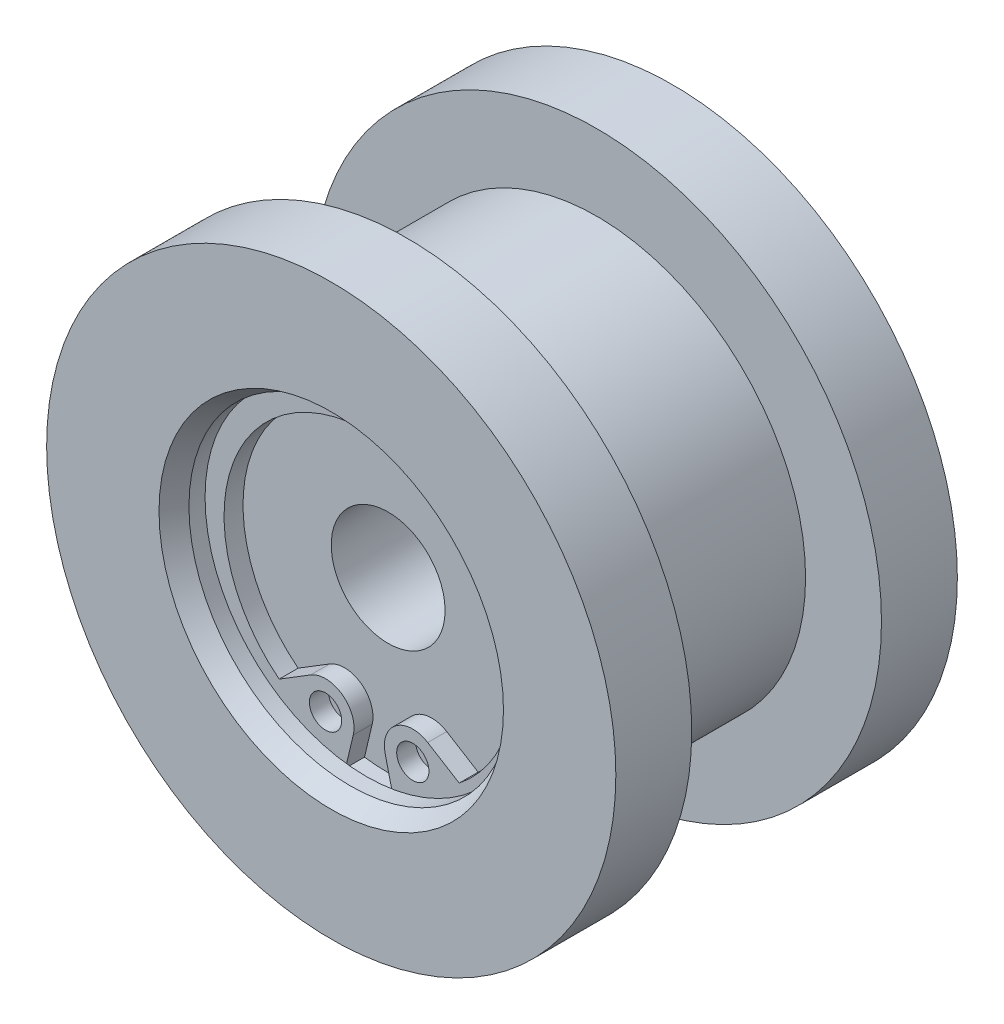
ISO-10303-21;
HEADER;
FILE_DESCRIPTION(('STEP AP214'),'2;1');
FILE_NAME('part.step','',(''),(''),'','','');
FILE_SCHEMA(('AUTOMOTIVE_DESIGN { 1 0 10303 214 1 1 1 1 }'));
ENDSEC;
DATA;
#1=APPLICATION_CONTEXT('core data for automotive mechanical design processes');
#2=APPLICATION_PROTOCOL_DEFINITION('international standard','automotive_design',2000,#1);
#3=PRODUCT_CONTEXT('',#1,'mechanical');
#4=PRODUCT('Part','Part','',(#3));
#5=PRODUCT_RELATED_PRODUCT_CATEGORY('part','',(#4));
#6=PRODUCT_DEFINITION_FORMATION('','',#4);
#7=PRODUCT_DEFINITION_CONTEXT('part definition',#1,'design');
#8=PRODUCT_DEFINITION('design','',#6,#7);
#9=PRODUCT_DEFINITION_SHAPE('','',#8);
#10=(LENGTH_UNIT() NAMED_UNIT(*) SI_UNIT(.MILLI.,.METRE.));
#11=(NAMED_UNIT(*) PLANE_ANGLE_UNIT() SI_UNIT($,.RADIAN.));
#12=(NAMED_UNIT(*) SI_UNIT($,.STERADIAN.) SOLID_ANGLE_UNIT());
#13=UNCERTAINTY_MEASURE_WITH_UNIT(LENGTH_MEASURE(1.E-05),#10,'distance_accuracy_value','');
#14=(GEOMETRIC_REPRESENTATION_CONTEXT(3) GLOBAL_UNCERTAINTY_ASSIGNED_CONTEXT((#13)) GLOBAL_UNIT_ASSIGNED_CONTEXT((#10,
#11,#12)) REPRESENTATION_CONTEXT('',''));
#15=CARTESIAN_POINT('',(0.,0.,0.));
#16=DIRECTION('',(0.,0.,1.));
#17=DIRECTION('',(1.,0.,0.));
#18=AXIS2_PLACEMENT_3D('',#15,#16,#17);
#19=CARTESIAN_POINT('',(0.,-0.5,7.));
#20=DIRECTION('',(0.,0.,1.));
#21=DIRECTION('',(-1.,0.,0.));
#22=AXIS2_PLACEMENT_3D('',#19,#20,#21);
#23=CYLINDRICAL_SURFACE('',#22,7.65);
#24=CARTESIAN_POINT('',(0.,-0.5,6.));
#25=DIRECTION('',(0.,0.,-1.));
#26=DIRECTION('',(0.,-1.,0.));
#27=AXIS2_PLACEMENT_3D('',#24,#25,#26);
#28=CIRCLE('',#27,7.65);
#29=CARTESIAN_POINT('',(-4.74513893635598,-6.50051301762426,6.));
#30=VERTEX_POINT('',#29);
#31=CARTESIAN_POINT('',(4.74513893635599,-6.50051301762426,6.));
#32=VERTEX_POINT('',#31);
#33=EDGE_CURVE('E110',#30,#32,#28,.T.);
#34=ORIENTED_EDGE('',*,*,#33,.T.);
#35=DIRECTION('',(0.,0.,-1.));
#36=VECTOR('',#35,1.);
#37=CARTESIAN_POINT('',(4.74513893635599,-6.50051301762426,7.));
#38=LINE('',#37,#36);
#39=CARTESIAN_POINT('',(4.74513893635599,-6.50051301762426,7.));
#40=VERTEX_POINT('',#39);
#41=EDGE_CURVE('E136',#40,#32,#38,.T.);
#42=ORIENTED_EDGE('',*,*,#41,.F.);
#43=CARTESIAN_POINT('',(0.,-0.5,7.));
#44=DIRECTION('',(0.,0.,-1.));
#45=DIRECTION('',(0.,-1.,0.));
#46=AXIS2_PLACEMENT_3D('',#43,#44,#45);
#47=CIRCLE('',#46,7.65);
#48=CARTESIAN_POINT('',(-4.74513893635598,-6.50051301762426,7.));
#49=VERTEX_POINT('',#48);
#50=EDGE_CURVE('E137',#49,#40,#47,.T.);
#51=ORIENTED_EDGE('',*,*,#50,.F.);
#52=DIRECTION('',(0.,0.,-1.));
#53=VECTOR('',#52,1.);
#54=CARTESIAN_POINT('',(-4.74513893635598,-6.50051301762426,7.));
#55=LINE('',#54,#53);
#56=EDGE_CURVE('E165',#49,#30,#55,.T.);
#57=ORIENTED_EDGE('',*,*,#56,.T.);
#58=EDGE_LOOP('',(#34,#42,#51,#57));
#59=FACE_BOUND('',#58,.T.);
#60=ADVANCED_FACE('F14',(#59),#23,.F.);
#61=CARTESIAN_POINT('',(3.08650226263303,-5.47917588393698,7.));
#62=DIRECTION('',(-0.524334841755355,-0.851512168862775,0.));
#63=DIRECTION('',(-0.851512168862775,0.524334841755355,0.));
#64=AXIS2_PLACEMENT_3D('',#61,#62,#63);
#65=PLANE('',#64);
#66=DIRECTION('',(-0.851512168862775,0.524334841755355,0.));
#67=VECTOR('',#66,1.);
#68=CARTESIAN_POINT('',(3.08650226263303,-5.47917588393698,6.));
#69=LINE('',#68,#67);
#70=CARTESIAN_POINT('',(3.08650226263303,-5.47917588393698,6.));
#71=VERTEX_POINT('',#70);
#72=EDGE_CURVE('E150',#32,#71,#69,.T.);
#73=ORIENTED_EDGE('',*,*,#72,.T.);
#74=DIRECTION('',(0.,0.,-1.));
#75=VECTOR('',#74,1.);
#76=CARTESIAN_POINT('',(3.08650226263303,-5.47917588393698,7.));
#77=LINE('',#76,#75);
#78=CARTESIAN_POINT('',(3.08650226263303,-5.47917588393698,7.));
#79=VERTEX_POINT('',#78);
#80=EDGE_CURVE('E145',#79,#71,#77,.T.);
#81=ORIENTED_EDGE('',*,*,#80,.F.);
#82=DIRECTION('',(-0.851512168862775,0.524334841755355,0.));
#83=VECTOR('',#82,1.);
#84=CARTESIAN_POINT('',(3.08650226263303,-5.47917588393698,7.));
#85=LINE('',#84,#83);
#86=EDGE_CURVE('E155',#40,#79,#85,.T.);
#87=ORIENTED_EDGE('',*,*,#86,.F.);
#88=ORIENTED_EDGE('',*,*,#41,.T.);
#89=EDGE_LOOP('',(#73,#81,#87,#88));
#90=FACE_BOUND('',#89,.T.);
#91=ADVANCED_FACE('F298',(#90),#65,.F.);
#92=CARTESIAN_POINT('',(2.3,-6.75644413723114,7.));
#93=DIRECTION('',(0.,0.,1.));
#94=DIRECTION('',(-1.,0.,0.));
#95=AXIS2_PLACEMENT_3D('',#92,#93,#94);
#96=CYLINDRICAL_SURFACE('',#95,1.5);
#97=CARTESIAN_POINT('',(2.3,-6.75644413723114,6.));
#98=DIRECTION('',(0.,0.,1.));
#99=DIRECTION('',(1.,0.,0.));
#100=AXIS2_PLACEMENT_3D('',#97,#98,#99);
#101=CIRCLE('',#100,1.5);
#102=CARTESIAN_POINT('',(0.840693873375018,-7.10346809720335,6.));
#103=VERTEX_POINT('',#102);
#104=EDGE_CURVE('E160',#71,#103,#101,.T.);
#105=ORIENTED_EDGE('',*,*,#104,.T.);
#106=DIRECTION('',(0.,0.,-1.));
#107=VECTOR('',#106,1.);
#108=CARTESIAN_POINT('',(0.840693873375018,-7.10346809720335,7.));
#109=LINE('',#108,#107);
#110=CARTESIAN_POINT('',(0.840693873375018,-7.10346809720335,7.));
#111=VERTEX_POINT('',#110);
#112=EDGE_CURVE('E146',#111,#103,#109,.T.);
#113=ORIENTED_EDGE('',*,*,#112,.F.);
#114=CARTESIAN_POINT('',(2.3,-6.75644413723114,7.));
#115=DIRECTION('',(0.,0.,1.));
#116=DIRECTION('',(1.,0.,0.));
#117=AXIS2_PLACEMENT_3D('',#114,#115,#116);
#118=CIRCLE('',#117,1.5);
#119=EDGE_CURVE('E151',#79,#111,#118,.T.);
#120=ORIENTED_EDGE('',*,*,#119,.F.);
#121=ORIENTED_EDGE('',*,*,#80,.T.);
#122=EDGE_LOOP('',(#105,#113,#120,#121));
#123=FACE_BOUND('',#122,.T.);
#124=ADVANCED_FACE('F244',(#123),#96,.T.);
#125=CARTESIAN_POINT('',(-0.84069387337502,-7.10346809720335,7.));
#126=DIRECTION('',(-0.97287075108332,0.231349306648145,0.));
#127=DIRECTION('',(0.,0.,1.));
#128=AXIS2_PLACEMENT_3D('',#125,#126,#127);
#129=PLANE('',#128);
#130=DIRECTION('',(0.,0.,1.));
#131=VECTOR('',#130,1.);
#132=CARTESIAN_POINT('',(-1.24703201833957,-8.81220240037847,5.6342229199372));
#133=LINE('',#132,#131);
#134=CARTESIAN_POINT('',(-1.24703201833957,-8.81220240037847,6.));
#135=VERTEX_POINT('',#134);
#136=CARTESIAN_POINT('',(-1.24703201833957,-8.81220240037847,7.));
#137=VERTEX_POINT('',#136);
#138=EDGE_CURVE('E115',#135,#137,#133,.T.);
#139=ORIENTED_EDGE('',*,*,#138,.F.);
#140=DIRECTION('',(0.231349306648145,0.97287075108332,0.));
#141=VECTOR('',#140,1.);
#142=CARTESIAN_POINT('',(-0.84069387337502,-7.10346809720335,6.));
#143=LINE('',#142,#141);
#144=CARTESIAN_POINT('',(-0.84069387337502,-7.10346809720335,6.));
#145=VERTEX_POINT('',#144);
#146=EDGE_CURVE('E103',#135,#145,#143,.T.);
#147=ORIENTED_EDGE('',*,*,#146,.T.);
#148=DIRECTION('',(0.,0.,-1.));
#149=VECTOR('',#148,1.);
#150=CARTESIAN_POINT('',(-0.84069387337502,-7.10346809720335,7.));
#151=LINE('',#150,#149);
#152=CARTESIAN_POINT('',(-0.84069387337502,-7.10346809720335,7.));
#153=VERTEX_POINT('',#152);
#154=EDGE_CURVE('E99',#153,#145,#151,.T.);
#155=ORIENTED_EDGE('',*,*,#154,.F.);
#156=DIRECTION('',(0.231349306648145,0.97287075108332,0.));
#157=VECTOR('',#156,1.);
#158=CARTESIAN_POINT('',(-0.84069387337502,-7.10346809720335,7.));
#159=LINE('',#158,#157);
#160=EDGE_CURVE('E141',#137,#153,#159,.T.);
#161=ORIENTED_EDGE('',*,*,#160,.F.);
#162=EDGE_LOOP('',(#139,#147,#155,#161));
#163=FACE_BOUND('',#162,.T.);
#164=ADVANCED_FACE('F265',(#163),#129,.F.);
#165=CARTESIAN_POINT('',(0.,-0.5,7.));
#166=DIRECTION('',(0.,0.,-1.));
#167=DIRECTION('',(0.,-1.,0.));
#168=AXIS2_PLACEMENT_3D('',#165,#166,#167);
#169=PLANE('',#168);
#170=CARTESIAN_POINT('',(2.3,-6.75644413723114,7.));
#171=DIRECTION('',(0.,0.,1.));
#172=DIRECTION('',(1.,0.,0.));
#173=AXIS2_PLACEMENT_3D('',#170,#171,#172);
#174=CIRCLE('',#173,0.85);
#175=CARTESIAN_POINT('',(3.15,-6.75644413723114,7.));
#176=VERTEX_POINT('',#175);
#177=EDGE_CURVE('E130',#176,#176,#174,.T.);
#178=ORIENTED_EDGE('',*,*,#177,.F.);
#179=EDGE_LOOP('',(#178));
#180=FACE_BOUND('',#179,.T.);
#181=CARTESIAN_POINT('',(-2.3,-6.75644413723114,7.));
#182=DIRECTION('',(0.,0.,-1.));
#183=DIRECTION('',(1.,0.,0.));
#184=AXIS2_PLACEMENT_3D('',#181,#182,#183);
#185=CIRCLE('',#184,0.85);
#186=CARTESIAN_POINT('',(-1.45,-6.75644413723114,7.));
#187=VERTEX_POINT('',#186);
#188=EDGE_CURVE('E142',#187,#187,#185,.T.);
#189=ORIENTED_EDGE('',*,*,#188,.T.);
#190=EDGE_LOOP('',(#189));
#191=FACE_BOUND('',#190,.T.);
#192=CARTESIAN_POINT('',(0.,0.,7.));
#193=DIRECTION('',(0.,0.,-1.));
#194=DIRECTION('',(-1.,0.,0.));
#195=AXIS2_PLACEMENT_3D('',#192,#193,#194);
#196=CIRCLE('',#195,8.9);
#197=CARTESIAN_POINT('',(1.24703201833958,-8.81220240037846,7.));
#198=VERTEX_POINT('',#197);
#199=EDGE_CURVE('E9',#137,#198,#196,.T.);
#200=ORIENTED_EDGE('',*,*,#199,.F.);
#201=ORIENTED_EDGE('',*,*,#160,.T.);
#202=CARTESIAN_POINT('',(-2.3,-6.75644413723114,7.));
#203=DIRECTION('',(0.,0.,1.));
#204=DIRECTION('',(-1.,0.,0.));
#205=AXIS2_PLACEMENT_3D('',#202,#203,#204);
#206=CIRCLE('',#205,1.5);
#207=CARTESIAN_POINT('',(-3.08650226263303,-5.47917588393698,7.));
#208=VERTEX_POINT('',#207);
#209=EDGE_CURVE('E138',#153,#208,#206,.T.);
#210=ORIENTED_EDGE('',*,*,#209,.T.);
#211=DIRECTION('',(-0.851512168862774,-0.524334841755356,0.));
#212=VECTOR('',#211,1.);
#213=CARTESIAN_POINT('',(-3.08650226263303,-5.47917588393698,7.));
#214=LINE('',#213,#212);
#215=EDGE_CURVE('E118',#208,#49,#214,.T.);
#216=ORIENTED_EDGE('',*,*,#215,.T.);
#217=ORIENTED_EDGE('',*,*,#50,.T.);
#218=ORIENTED_EDGE('',*,*,#86,.T.);
#219=ORIENTED_EDGE('',*,*,#119,.T.);
#220=DIRECTION('',(0.231349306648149,-0.972870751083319,0.));
#221=VECTOR('',#220,1.);
#222=CARTESIAN_POINT('',(0.840693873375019,-7.10346809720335,7.));
#223=LINE('',#222,#221);
#224=EDGE_CURVE('E156',#111,#198,#223,.T.);
#225=ORIENTED_EDGE('',*,*,#224,.T.);
#226=EDGE_LOOP('',(#200,#201,#210,#216,#217,#218,#219,#225));
#227=FACE_BOUND('',#226,.T.);
#228=ADVANCED_FACE('F261',(#180,#191,#227),#169,.F.);
#229=CARTESIAN_POINT('',(2.3,-6.75644413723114,7.));
#230=DIRECTION('',(0.,0.,1.));
#231=DIRECTION('',(-1.,0.,0.));
#232=AXIS2_PLACEMENT_3D('',#229,#230,#231);
#233=CYLINDRICAL_SURFACE('',#232,0.85);
#234=CARTESIAN_POINT('',(2.3,-6.75644413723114,6.));
#235=DIRECTION('',(0.,0.,1.));
#236=DIRECTION('',(1.,0.,0.));
#237=AXIS2_PLACEMENT_3D('',#234,#235,#236);
#238=CIRCLE('',#237,0.85);
#239=CARTESIAN_POINT('',(3.15,-6.75644413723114,6.));
#240=VERTEX_POINT('',#239);
#241=EDGE_CURVE('E120',#240,#240,#238,.T.);
#242=ORIENTED_EDGE('',*,*,#241,.F.);
#243=EDGE_LOOP('',(#242));
#244=FACE_BOUND('',#243,.T.);
#245=ORIENTED_EDGE('',*,*,#177,.T.);
#246=EDGE_LOOP('',(#245));
#247=FACE_BOUND('',#246,.T.);
#248=ADVANCED_FACE('F310',(#244,#247),#233,.F.);
#249=CARTESIAN_POINT('',(-2.3,-6.75644413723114,7.));
#250=DIRECTION('',(0.,0.,1.));
#251=DIRECTION('',(-1.,0.,0.));
#252=AXIS2_PLACEMENT_3D('',#249,#250,#251);
#253=CYLINDRICAL_SURFACE('',#252,0.85);
#254=CARTESIAN_POINT('',(-2.3,-6.75644413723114,6.));
#255=DIRECTION('',(0.,0.,-1.));
#256=DIRECTION('',(1.,0.,0.));
#257=AXIS2_PLACEMENT_3D('',#254,#255,#256);
#258=CIRCLE('',#257,0.85);
#259=CARTESIAN_POINT('',(-1.45,-6.75644413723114,6.));
#260=VERTEX_POINT('',#259);
#261=EDGE_CURVE('E133',#260,#260,#258,.T.);
#262=ORIENTED_EDGE('',*,*,#261,.T.);
#263=EDGE_LOOP('',(#262));
#264=FACE_BOUND('',#263,.T.);
#265=ORIENTED_EDGE('',*,*,#188,.F.);
#266=EDGE_LOOP('',(#265));
#267=FACE_BOUND('',#266,.T.);
#268=ADVANCED_FACE('F507',(#264,#267),#253,.F.);
#269=CARTESIAN_POINT('',(-3.08650226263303,-5.47917588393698,7.));
#270=DIRECTION('',(0.524334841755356,-0.851512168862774,0.));
#271=DIRECTION('',(0.,0.,-1.));
#272=AXIS2_PLACEMENT_3D('',#269,#270,#271);
#273=PLANE('',#272);
#274=DIRECTION('',(-0.851512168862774,-0.524334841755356,0.));
#275=VECTOR('',#274,1.);
#276=CARTESIAN_POINT('',(-3.08650226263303,-5.47917588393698,6.));
#277=LINE('',#276,#275);
#278=CARTESIAN_POINT('',(-3.08650226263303,-5.47917588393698,6.));
#279=VERTEX_POINT('',#278);
#280=EDGE_CURVE('E106',#279,#30,#277,.T.);
#281=ORIENTED_EDGE('',*,*,#280,.T.);
#282=ORIENTED_EDGE('',*,*,#56,.F.);
#283=ORIENTED_EDGE('',*,*,#215,.F.);
#284=DIRECTION('',(0.,0.,-1.));
#285=VECTOR('',#284,1.);
#286=CARTESIAN_POINT('',(-3.08650226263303,-5.47917588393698,7.));
#287=LINE('',#286,#285);
#288=EDGE_CURVE('E96',#208,#279,#287,.T.);
#289=ORIENTED_EDGE('',*,*,#288,.T.);
#290=EDGE_LOOP('',(#281,#282,#283,#289));
#291=FACE_BOUND('',#290,.T.);
#292=ADVANCED_FACE('F117',(#291),#273,.F.);
#293=CARTESIAN_POINT('',(-2.3,-6.75644413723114,7.));
#294=DIRECTION('',(0.,0.,1.));
#295=DIRECTION('',(-1.,0.,0.));
#296=AXIS2_PLACEMENT_3D('',#293,#294,#295);
#297=CYLINDRICAL_SURFACE('',#296,1.5);
#298=CARTESIAN_POINT('',(-2.3,-6.75644413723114,6.));
#299=DIRECTION('',(0.,0.,1.));
#300=DIRECTION('',(-1.,0.,0.));
#301=AXIS2_PLACEMENT_3D('',#298,#299,#300);
#302=CIRCLE('',#301,1.5);
#303=EDGE_CURVE('E91',#145,#279,#302,.T.);
#304=ORIENTED_EDGE('',*,*,#303,.T.);
#305=ORIENTED_EDGE('',*,*,#288,.F.);
#306=ORIENTED_EDGE('',*,*,#209,.F.);
#307=ORIENTED_EDGE('',*,*,#154,.T.);
#308=EDGE_LOOP('',(#304,#305,#306,#307));
#309=FACE_BOUND('',#308,.T.);
#310=ADVANCED_FACE('F93',(#309),#297,.T.);
#311=CARTESIAN_POINT('',(0.840693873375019,-7.10346809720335,7.));
#312=DIRECTION('',(0.972870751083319,0.231349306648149,0.));
#313=DIRECTION('',(0.,0.,-1.));
#314=AXIS2_PLACEMENT_3D('',#311,#312,#313);
#315=PLANE('',#314);
#316=DIRECTION('',(0.,0.,1.));
#317=VECTOR('',#316,1.);
#318=CARTESIAN_POINT('',(1.24703201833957,-8.81220240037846,5.6342229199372));
#319=LINE('',#318,#317);
#320=CARTESIAN_POINT('',(1.24703201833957,-8.81220240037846,6.));
#321=VERTEX_POINT('',#320);
#322=EDGE_CURVE('E18',#198,#321,#319,.F.);
#323=ORIENTED_EDGE('',*,*,#322,.F.);
#324=ORIENTED_EDGE('',*,*,#224,.F.);
#325=ORIENTED_EDGE('',*,*,#112,.T.);
#326=DIRECTION('',(0.231349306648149,-0.972870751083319,0.));
#327=VECTOR('',#326,1.);
#328=CARTESIAN_POINT('',(0.840693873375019,-7.10346809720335,6.));
#329=LINE('',#328,#327);
#330=EDGE_CURVE('E32',#103,#321,#329,.T.);
#331=ORIENTED_EDGE('',*,*,#330,.T.);
#332=EDGE_LOOP('',(#323,#324,#325,#331));
#333=FACE_BOUND('',#332,.T.);
#334=ADVANCED_FACE('F247',(#333),#315,.F.);
#335=CARTESIAN_POINT('',(0.,3.,6.));
#336=DIRECTION('',(0.,0.,-1.));
#337=DIRECTION('',(-1.,0.,0.));
#338=AXIS2_PLACEMENT_3D('',#335,#336,#337);
#339=PLANE('',#338);
#340=ORIENTED_EDGE('',*,*,#241,.T.);
#341=EDGE_LOOP('',(#340));
#342=FACE_BOUND('',#341,.T.);
#343=ADVANCED_FACE('F284',(#342),#339,.F.);
#344=ORIENTED_EDGE('',*,*,#261,.F.);
#345=EDGE_LOOP('',(#344));
#346=FACE_BOUND('',#345,.T.);
#347=ADVANCED_FACE('F286',(#346),#339,.F.);
#348=CARTESIAN_POINT('',(0.,0.,5.6342229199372));
#349=DIRECTION('',(0.,0.,1.));
#350=DIRECTION('',(1.,0.,0.));
#351=AXIS2_PLACEMENT_3D('',#348,#349,#350);
#352=CYLINDRICAL_SURFACE('',#351,11.);
#353=CARTESIAN_POINT('',(0.,0.,5.));
#354=DIRECTION('',(0.,0.,-1.));
#355=DIRECTION('',(-1.,0.,0.));
#356=AXIS2_PLACEMENT_3D('',#353,#354,#355);
#357=CIRCLE('',#356,11.);
#358=CARTESIAN_POINT('',(-11.,0.,5.));
#359=VERTEX_POINT('',#358);
#360=EDGE_CURVE('E172',#359,#359,#357,.T.);
#361=ORIENTED_EDGE('',*,*,#360,.T.);
#362=EDGE_LOOP('',(#361));
#363=FACE_BOUND('',#362,.T.);
#364=CARTESIAN_POINT('',(0.,0.,-5.));
#365=DIRECTION('',(0.,0.,1.));
#366=DIRECTION('',(1.,0.,0.));
#367=AXIS2_PLACEMENT_3D('',#364,#365,#366);
#368=CIRCLE('',#367,11.);
#369=CARTESIAN_POINT('',(11.,0.,-5.));
#370=VERTEX_POINT('',#369);
#371=EDGE_CURVE('E178',#370,#370,#368,.T.);
#372=ORIENTED_EDGE('',*,*,#371,.T.);
#373=EDGE_LOOP('',(#372));
#374=FACE_BOUND('',#373,.T.);
#375=ADVANCED_FACE('F292',(#363,#374),#352,.T.);
#376=CARTESIAN_POINT('',(0.,0.,5.));
#377=DIRECTION('',(0.,0.,-1.));
#378=DIRECTION('',(-1.,0.,0.));
#379=AXIS2_PLACEMENT_3D('',#376,#377,#378);
#380=PLANE('',#379);
#381=CARTESIAN_POINT('',(0.,0.,5.));
#382=DIRECTION('',(0.,0.,-1.));
#383=DIRECTION('',(-1.,0.,0.));
#384=AXIS2_PLACEMENT_3D('',#381,#382,#383);
#385=CIRCLE('',#384,15.);
#386=CARTESIAN_POINT('',(-15.,0.,5.));
#387=VERTEX_POINT('',#386);
#388=EDGE_CURVE('E175',#387,#387,#385,.T.);
#389=ORIENTED_EDGE('',*,*,#388,.T.);
#390=EDGE_LOOP('',(#389));
#391=FACE_BOUND('',#390,.T.);
#392=ORIENTED_EDGE('',*,*,#360,.F.);
#393=EDGE_LOOP('',(#392));
#394=FACE_BOUND('',#393,.T.);
#395=ADVANCED_FACE('F314',(#391,#394),#380,.T.);
#396=CARTESIAN_POINT('',(0.,0.,-5.));
#397=DIRECTION('',(0.,0.,1.));
#398=DIRECTION('',(1.,0.,0.));
#399=AXIS2_PLACEMENT_3D('',#396,#397,#398);
#400=PLANE('',#399);
#401=CARTESIAN_POINT('',(0.,0.,-5.));
#402=DIRECTION('',(0.,0.,1.));
#403=DIRECTION('',(1.,0.,0.));
#404=AXIS2_PLACEMENT_3D('',#401,#402,#403);
#405=CIRCLE('',#404,15.);
#406=CARTESIAN_POINT('',(15.,0.,-5.));
#407=VERTEX_POINT('',#406);
#408=EDGE_CURVE('E181',#407,#407,#405,.T.);
#409=ORIENTED_EDGE('',*,*,#408,.T.);
#410=EDGE_LOOP('',(#409));
#411=FACE_BOUND('',#410,.T.);
#412=ORIENTED_EDGE('',*,*,#371,.F.);
#413=EDGE_LOOP('',(#412));
#414=FACE_BOUND('',#413,.T.);
#415=ADVANCED_FACE('F317',(#411,#414),#400,.T.);
#416=CARTESIAN_POINT('',(0.,0.,5.6342229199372));
#417=DIRECTION('',(0.,0.,1.));
#418=DIRECTION('',(1.,0.,0.));
#419=AXIS2_PLACEMENT_3D('',#416,#417,#418);
#420=CYLINDRICAL_SURFACE('',#419,15.);
#421=CARTESIAN_POINT('',(0.,0.,9.));
#422=DIRECTION('',(0.,0.,1.));
#423=DIRECTION('',(1.,0.,0.));
#424=AXIS2_PLACEMENT_3D('',#421,#422,#423);
#425=CIRCLE('',#424,15.);
#426=CARTESIAN_POINT('',(15.,0.,9.));
#427=VERTEX_POINT('',#426);
#428=EDGE_CURVE('E213',#427,#427,#425,.T.);
#429=ORIENTED_EDGE('',*,*,#428,.F.);
#430=EDGE_LOOP('',(#429));
#431=FACE_BOUND('',#430,.T.);
#432=ORIENTED_EDGE('',*,*,#388,.F.);
#433=EDGE_LOOP('',(#432));
#434=FACE_BOUND('',#433,.T.);
#435=ADVANCED_FACE('F321',(#431,#434),#420,.T.);
#436=CARTESIAN_POINT('',(0.,0.,5.6342229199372));
#437=DIRECTION('',(0.,0.,1.));
#438=DIRECTION('',(1.,0.,0.));
#439=AXIS2_PLACEMENT_3D('',#436,#437,#438);
#440=CYLINDRICAL_SURFACE('',#439,15.);
#441=CARTESIAN_POINT('',(0.,0.,-9.));
#442=DIRECTION('',(0.,0.,1.));
#443=DIRECTION('',(1.,0.,0.));
#444=AXIS2_PLACEMENT_3D('',#441,#442,#443);
#445=CIRCLE('',#444,15.);
#446=CARTESIAN_POINT('',(15.,0.,-9.));
#447=VERTEX_POINT('',#446);
#448=EDGE_CURVE('E184',#447,#447,#445,.T.);
#449=ORIENTED_EDGE('',*,*,#448,.T.);
#450=EDGE_LOOP('',(#449));
#451=FACE_BOUND('',#450,.T.);
#452=ORIENTED_EDGE('',*,*,#408,.F.);
#453=EDGE_LOOP('',(#452));
#454=FACE_BOUND('',#453,.T.);
#455=ADVANCED_FACE('F16',(#451,#454),#440,.T.);
#456=CARTESIAN_POINT('',(0.,15.,9.));
#457=DIRECTION('',(0.,0.,-1.));
#458=DIRECTION('',(-1.,0.,0.));
#459=AXIS2_PLACEMENT_3D('',#456,#457,#458);
#460=PLANE('',#459);
#461=CARTESIAN_POINT('',(0.,0.,9.));
#462=DIRECTION('',(0.,0.,1.));
#463=DIRECTION('',(1.,0.,0.));
#464=AXIS2_PLACEMENT_3D('',#461,#462,#463);
#465=CIRCLE('',#464,9.07735026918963);
#466=CARTESIAN_POINT('',(9.07735026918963,0.,9.));
#467=VERTEX_POINT('',#466);
#468=EDGE_CURVE('E210',#467,#467,#465,.T.);
#469=ORIENTED_EDGE('',*,*,#468,.F.);
#470=EDGE_LOOP('',(#469));
#471=FACE_BOUND('',#470,.T.);
#472=ORIENTED_EDGE('',*,*,#428,.T.);
#473=EDGE_LOOP('',(#472));
#474=FACE_BOUND('',#473,.T.);
#475=ADVANCED_FACE('F327',(#471,#474),#460,.F.);
#476=CARTESIAN_POINT('',(0.,6.5,-9.));
#477=DIRECTION('',(0.,0.,1.));
#478=DIRECTION('',(1.,0.,0.));
#479=AXIS2_PLACEMENT_3D('',#476,#477,#478);
#480=PLANE('',#479);
#481=ORIENTED_EDGE('',*,*,#448,.F.);
#482=EDGE_LOOP('',(#481));
#483=FACE_BOUND('',#482,.T.);
#484=CARTESIAN_POINT('',(0.,0.,-9.));
#485=DIRECTION('',(0.,0.,1.));
#486=DIRECTION('',(1.,0.,0.));
#487=AXIS2_PLACEMENT_3D('',#484,#485,#486);
#488=CIRCLE('',#487,6.5);
#489=CARTESIAN_POINT('',(6.5,0.,-9.));
#490=VERTEX_POINT('',#489);
#491=EDGE_CURVE('E187',#490,#490,#488,.T.);
#492=ORIENTED_EDGE('',*,*,#491,.T.);
#493=EDGE_LOOP('',(#492));
#494=FACE_BOUND('',#493,.T.);
#495=ADVANCED_FACE('F323',(#483,#494),#480,.F.);
#496=CARTESIAN_POINT('',(0.,0.,9.));
#497=DIRECTION('',(0.,0.,1.));
#498=DIRECTION('',(1.,0.,0.));
#499=AXIS2_PLACEMENT_3D('',#496,#497,#498);
#500=CONICAL_SURFACE('',#499,9.07735026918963,0.5235987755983);
#501=CARTESIAN_POINT('',(0.,0.,8.));
#502=DIRECTION('',(0.,0.,1.));
#503=DIRECTION('',(1.,0.,0.));
#504=AXIS2_PLACEMENT_3D('',#501,#502,#503);
#505=CIRCLE('',#504,8.5);
#506=CARTESIAN_POINT('',(8.5,0.,8.));
#507=VERTEX_POINT('',#506);
#508=EDGE_CURVE('E207',#507,#507,#505,.T.);
#509=ORIENTED_EDGE('',*,*,#508,.F.);
#510=EDGE_LOOP('',(#509));
#511=FACE_BOUND('',#510,.T.);
#512=ORIENTED_EDGE('',*,*,#468,.T.);
#513=EDGE_LOOP('',(#512));
#514=FACE_BOUND('',#513,.T.);
#515=ADVANCED_FACE('F326',(#511,#514),#500,.F.);
#516=CARTESIAN_POINT('',(0.,0.,5.6342229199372));
#517=DIRECTION('',(0.,0.,1.));
#518=DIRECTION('',(1.,0.,0.));
#519=AXIS2_PLACEMENT_3D('',#516,#517,#518);
#520=CYLINDRICAL_SURFACE('',#519,6.5);
#521=ORIENTED_EDGE('',*,*,#491,.F.);
#522=EDGE_LOOP('',(#521));
#523=FACE_BOUND('',#522,.T.);
#524=CARTESIAN_POINT('',(0.,0.,-6.));
#525=DIRECTION('',(0.,0.,1.));
#526=DIRECTION('',(1.,0.,0.));
#527=AXIS2_PLACEMENT_3D('',#524,#525,#526);
#528=CIRCLE('',#527,6.5);
#529=CARTESIAN_POINT('',(6.5,0.,-6.));
#530=VERTEX_POINT('',#529);
#531=EDGE_CURVE('E190',#530,#530,#528,.T.);
#532=ORIENTED_EDGE('',*,*,#531,.T.);
#533=EDGE_LOOP('',(#532));
#534=FACE_BOUND('',#533,.T.);
#535=ADVANCED_FACE('F329',(#523,#534),#520,.F.);
#536=CARTESIAN_POINT('',(0.,0.,5.6342229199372));
#537=DIRECTION('',(0.,0.,1.));
#538=DIRECTION('',(1.,0.,0.));
#539=AXIS2_PLACEMENT_3D('',#536,#537,#538);
#540=CYLINDRICAL_SURFACE('',#539,8.5);
#541=CARTESIAN_POINT('',(0.,0.,7.15));
#542=DIRECTION('',(0.,0.,1.));
#543=DIRECTION('',(1.,0.,0.));
#544=AXIS2_PLACEMENT_3D('',#541,#542,#543);
#545=CIRCLE('',#544,8.5);
#546=CARTESIAN_POINT('',(8.5,0.,7.15));
#547=VERTEX_POINT('',#546);
#548=EDGE_CURVE('E204',#547,#547,#545,.T.);
#549=ORIENTED_EDGE('',*,*,#548,.F.);
#550=EDGE_LOOP('',(#549));
#551=FACE_BOUND('',#550,.T.);
#552=ORIENTED_EDGE('',*,*,#508,.T.);
#553=EDGE_LOOP('',(#552));
#554=FACE_BOUND('',#553,.T.);
#555=ADVANCED_FACE('F332',(#551,#554),#540,.F.);
#556=CARTESIAN_POINT('',(0.,6.5,-6.));
#557=DIRECTION('',(0.,0.,1.));
#558=DIRECTION('',(1.,0.,0.));
#559=AXIS2_PLACEMENT_3D('',#556,#557,#558);
#560=PLANE('',#559);
#561=ORIENTED_EDGE('',*,*,#531,.F.);
#562=EDGE_LOOP('',(#561));
#563=FACE_BOUND('',#562,.T.);
#564=CARTESIAN_POINT('',(0.,0.,-6.));
#565=DIRECTION('',(0.,0.,1.));
#566=DIRECTION('',(1.,0.,0.));
#567=AXIS2_PLACEMENT_3D('',#564,#565,#566);
#568=CIRCLE('',#567,3.);
#569=CARTESIAN_POINT('',(3.,0.,-6.));
#570=VERTEX_POINT('',#569);
#571=EDGE_CURVE('E193',#570,#570,#568,.T.);
#572=ORIENTED_EDGE('',*,*,#571,.T.);
#573=EDGE_LOOP('',(#572));
#574=FACE_BOUND('',#573,.T.);
#575=ADVANCED_FACE('F280',(#563,#574),#560,.F.);
#576=CARTESIAN_POINT('',(0.,8.9,7.15));
#577=DIRECTION('',(0.,0.,1.));
#578=DIRECTION('',(1.,0.,0.));
#579=AXIS2_PLACEMENT_3D('',#576,#577,#578);
#580=PLANE('',#579);
#581=CARTESIAN_POINT('',(0.,0.,7.15));
#582=DIRECTION('',(0.,0.,1.));
#583=DIRECTION('',(1.,0.,0.));
#584=AXIS2_PLACEMENT_3D('',#581,#582,#583);
#585=CIRCLE('',#584,8.9);
#586=CARTESIAN_POINT('',(8.9,0.,7.15));
#587=VERTEX_POINT('',#586);
#588=EDGE_CURVE('E201',#587,#587,#585,.T.);
#589=ORIENTED_EDGE('',*,*,#588,.F.);
#590=EDGE_LOOP('',(#589));
#591=FACE_BOUND('',#590,.T.);
#592=ORIENTED_EDGE('',*,*,#548,.T.);
#593=EDGE_LOOP('',(#592));
#594=FACE_BOUND('',#593,.T.);
#595=ADVANCED_FACE('F270',(#591,#594),#580,.F.);
#596=CARTESIAN_POINT('',(0.,0.,5.6342229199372));
#597=DIRECTION('',(0.,0.,1.));
#598=DIRECTION('',(1.,0.,0.));
#599=AXIS2_PLACEMENT_3D('',#596,#597,#598);
#600=CYLINDRICAL_SURFACE('',#599,8.9);
#601=ORIENTED_EDGE('',*,*,#588,.T.);
#602=EDGE_LOOP('',(#601));
#603=FACE_BOUND('',#602,.T.);
#604=ORIENTED_EDGE('',*,*,#199,.T.);
#605=ORIENTED_EDGE('',*,*,#322,.T.);
#606=CARTESIAN_POINT('',(0.,0.,6.));
#607=DIRECTION('',(0.,0.,1.));
#608=DIRECTION('',(1.,0.,0.));
#609=AXIS2_PLACEMENT_3D('',#606,#607,#608);
#610=CIRCLE('',#609,8.9);
#611=EDGE_CURVE('E199',#135,#321,#610,.T.);
#612=ORIENTED_EDGE('',*,*,#611,.F.);
#613=ORIENTED_EDGE('',*,*,#138,.T.);
#614=EDGE_LOOP('',(#604,#605,#612,#613));
#615=FACE_BOUND('',#614,.T.);
#616=ADVANCED_FACE('F267',(#603,#615),#600,.F.);
#617=CARTESIAN_POINT('',(0.,0.,5.6342229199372));
#618=DIRECTION('',(0.,0.,1.));
#619=DIRECTION('',(1.,0.,0.));
#620=AXIS2_PLACEMENT_3D('',#617,#618,#619);
#621=CYLINDRICAL_SURFACE('',#620,3.);
#622=ORIENTED_EDGE('',*,*,#571,.F.);
#623=EDGE_LOOP('',(#622));
#624=FACE_BOUND('',#623,.T.);
#625=CARTESIAN_POINT('',(0.,0.,6.));
#626=DIRECTION('',(0.,0.,1.));
#627=DIRECTION('',(1.,0.,0.));
#628=AXIS2_PLACEMENT_3D('',#625,#626,#627);
#629=CIRCLE('',#628,3.);
#630=CARTESIAN_POINT('',(3.,0.,6.));
#631=VERTEX_POINT('',#630);
#632=EDGE_CURVE('E196',#631,#631,#629,.T.);
#633=ORIENTED_EDGE('',*,*,#632,.T.);
#634=EDGE_LOOP('',(#633));
#635=FACE_BOUND('',#634,.T.);
#636=ADVANCED_FACE('F269',(#624,#635),#621,.F.);
#637=ORIENTED_EDGE('',*,*,#632,.F.);
#638=EDGE_LOOP('',(#637));
#639=FACE_BOUND('',#638,.T.);
#640=ORIENTED_EDGE('',*,*,#611,.T.);
#641=ORIENTED_EDGE('',*,*,#330,.F.);
#642=ORIENTED_EDGE('',*,*,#104,.F.);
#643=ORIENTED_EDGE('',*,*,#72,.F.);
#644=ORIENTED_EDGE('',*,*,#33,.F.);
#645=ORIENTED_EDGE('',*,*,#280,.F.);
#646=ORIENTED_EDGE('',*,*,#303,.F.);
#647=ORIENTED_EDGE('',*,*,#146,.F.);
#648=EDGE_LOOP('',(#640,#641,#642,#643,#644,#645,#646,#647));
#649=FACE_BOUND('',#648,.T.);
#650=ADVANCED_FACE('F108',(#639,#649),#339,.F.);
#651=CLOSED_SHELL('',(#60,#91,#124,#164,#228,#248,#268,#292,#310,#334,#343,#347,#375,#395,#415,
#435,#455,#475,#495,#515,#535,#555,#575,#595,#616,#636,#650));
#652=MANIFOLD_SOLID_BREP('B1',#651);
#653=ADVANCED_BREP_SHAPE_REPRESENTATION('',(#18,#652),#14);
#654=SHAPE_DEFINITION_REPRESENTATION(#9,#653);
ENDSEC;
END-ISO-10303-21;
